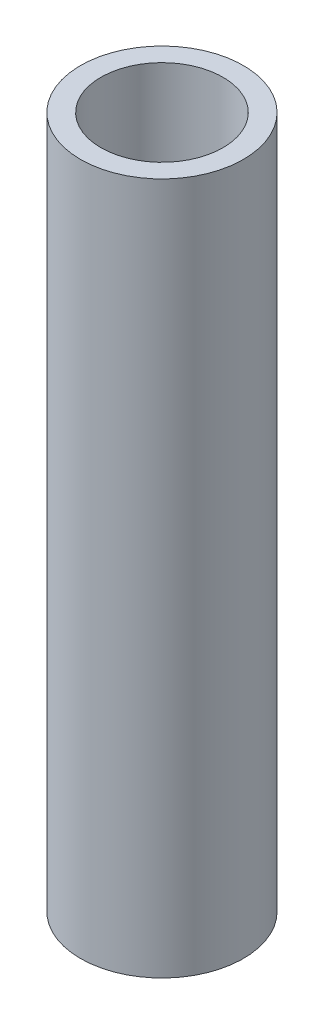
ISO-10303-21;
HEADER;
FILE_DESCRIPTION(('STEP AP214'),'2;1');
FILE_NAME('part.step','',(''),(''),'','','');
FILE_SCHEMA(('AUTOMOTIVE_DESIGN { 1 0 10303 214 1 1 1 1 }'));
ENDSEC;
DATA;
#1=APPLICATION_CONTEXT('core data for automotive mechanical design processes');
#2=APPLICATION_PROTOCOL_DEFINITION('international standard','automotive_design',2000,#1);
#3=PRODUCT_CONTEXT('',#1,'mechanical');
#4=PRODUCT('Part','Part','',(#3));
#5=PRODUCT_RELATED_PRODUCT_CATEGORY('part','',(#4));
#6=PRODUCT_DEFINITION_FORMATION('','',#4);
#7=PRODUCT_DEFINITION_CONTEXT('part definition',#1,'design');
#8=PRODUCT_DEFINITION('design','',#6,#7);
#9=PRODUCT_DEFINITION_SHAPE('','',#8);
#10=(LENGTH_UNIT() NAMED_UNIT(*) SI_UNIT(.MILLI.,.METRE.));
#11=(NAMED_UNIT(*) PLANE_ANGLE_UNIT() SI_UNIT($,.RADIAN.));
#12=(NAMED_UNIT(*) SI_UNIT($,.STERADIAN.) SOLID_ANGLE_UNIT());
#13=UNCERTAINTY_MEASURE_WITH_UNIT(LENGTH_MEASURE(1.E-05),#10,'distance_accuracy_value','');
#14=(GEOMETRIC_REPRESENTATION_CONTEXT(3) GLOBAL_UNCERTAINTY_ASSIGNED_CONTEXT((#13)) GLOBAL_UNIT_ASSIGNED_CONTEXT((#10,
#11,#12)) REPRESENTATION_CONTEXT('',''));
#15=CARTESIAN_POINT('',(0.,0.,0.));
#16=DIRECTION('',(0.,0.,1.));
#17=DIRECTION('',(1.,0.,0.));
#18=AXIS2_PLACEMENT_3D('',#15,#16,#17);
#19=CARTESIAN_POINT('',(0.,51.,0.));
#20=DIRECTION('',(0.,1.,0.));
#21=DIRECTION('',(0.,0.,1.));
#22=AXIS2_PLACEMENT_3D('',#19,#20,#21);
#23=PLANE('',#22);
#24=CARTESIAN_POINT('',(0.,51.,0.));
#25=DIRECTION('',(0.,1.,0.));
#26=DIRECTION('',(0.,0.,1.));
#27=AXIS2_PLACEMENT_3D('',#24,#25,#26);
#28=CIRCLE('',#27,12.);
#29=CARTESIAN_POINT('',(0.,51.,12.));
#30=VERTEX_POINT('',#29);
#31=EDGE_CURVE('E10',#30,#30,#28,.T.);
#32=ORIENTED_EDGE('',*,*,#31,.T.);
#33=EDGE_LOOP('',(#32));
#34=FACE_BOUND('',#33,.T.);
#35=CARTESIAN_POINT('',(0.,51.,0.));
#36=DIRECTION('',(0.,1.,0.));
#37=DIRECTION('',(0.,0.,1.));
#38=AXIS2_PLACEMENT_3D('',#35,#36,#37);
#39=CIRCLE('',#38,9.);
#40=CARTESIAN_POINT('',(0.,51.,9.));
#41=VERTEX_POINT('',#40);
#42=EDGE_CURVE('E43',#41,#41,#39,.T.);
#43=ORIENTED_EDGE('',*,*,#42,.F.);
#44=EDGE_LOOP('',(#43));
#45=FACE_BOUND('',#44,.T.);
#46=ADVANCED_FACE('F32',(#34,#45),#23,.T.);
#47=CARTESIAN_POINT('',(0.,-51.,0.));
#48=DIRECTION('',(0.,1.,0.));
#49=DIRECTION('',(0.,0.,1.));
#50=AXIS2_PLACEMENT_3D('',#47,#48,#49);
#51=PLANE('',#50);
#52=CARTESIAN_POINT('',(0.,-51.,0.));
#53=DIRECTION('',(0.,1.,0.));
#54=DIRECTION('',(0.,0.,1.));
#55=AXIS2_PLACEMENT_3D('',#52,#53,#54);
#56=CIRCLE('',#55,12.);
#57=CARTESIAN_POINT('',(0.,-51.,12.));
#58=VERTEX_POINT('',#57);
#59=EDGE_CURVE('E36',#58,#58,#56,.T.);
#60=ORIENTED_EDGE('',*,*,#59,.F.);
#61=EDGE_LOOP('',(#60));
#62=FACE_BOUND('',#61,.T.);
#63=CARTESIAN_POINT('',(0.,-51.,0.));
#64=DIRECTION('',(0.,1.,0.));
#65=DIRECTION('',(0.,0.,1.));
#66=AXIS2_PLACEMENT_3D('',#63,#64,#65);
#67=CIRCLE('',#66,9.);
#68=CARTESIAN_POINT('',(0.,-51.,9.));
#69=VERTEX_POINT('',#68);
#70=EDGE_CURVE('E45',#69,#69,#67,.T.);
#71=ORIENTED_EDGE('',*,*,#70,.T.);
#72=EDGE_LOOP('',(#71));
#73=FACE_BOUND('',#72,.T.);
#74=ADVANCED_FACE('F55',(#62,#73),#51,.F.);
#75=CARTESIAN_POINT('',(0.,51.,0.));
#76=DIRECTION('',(0.,-1.,0.));
#77=DIRECTION('',(0.,0.,-1.));
#78=AXIS2_PLACEMENT_3D('',#75,#76,#77);
#79=CYLINDRICAL_SURFACE('',#78,12.);
#80=ORIENTED_EDGE('',*,*,#31,.F.);
#81=EDGE_LOOP('',(#80));
#82=FACE_BOUND('',#81,.T.);
#83=ORIENTED_EDGE('',*,*,#59,.T.);
#84=EDGE_LOOP('',(#83));
#85=FACE_BOUND('',#84,.T.);
#86=ADVANCED_FACE('F34',(#82,#85),#79,.T.);
#87=CARTESIAN_POINT('',(0.,51.,0.));
#88=DIRECTION('',(0.,-1.,0.));
#89=DIRECTION('',(0.,0.,-1.));
#90=AXIS2_PLACEMENT_3D('',#87,#88,#89);
#91=CYLINDRICAL_SURFACE('',#90,9.);
#92=ORIENTED_EDGE('',*,*,#42,.T.);
#93=EDGE_LOOP('',(#92));
#94=FACE_BOUND('',#93,.T.);
#95=ORIENTED_EDGE('',*,*,#70,.F.);
#96=EDGE_LOOP('',(#95));
#97=FACE_BOUND('',#96,.T.);
#98=ADVANCED_FACE('F51',(#94,#97),#91,.F.);
#99=CLOSED_SHELL('',(#46,#74,#86,#98));
#100=MANIFOLD_SOLID_BREP('B2',#99);
#101=ADVANCED_BREP_SHAPE_REPRESENTATION('',(#18,#100),#14);
#102=SHAPE_DEFINITION_REPRESENTATION(#9,#101);
ENDSEC;
END-ISO-10303-21;
